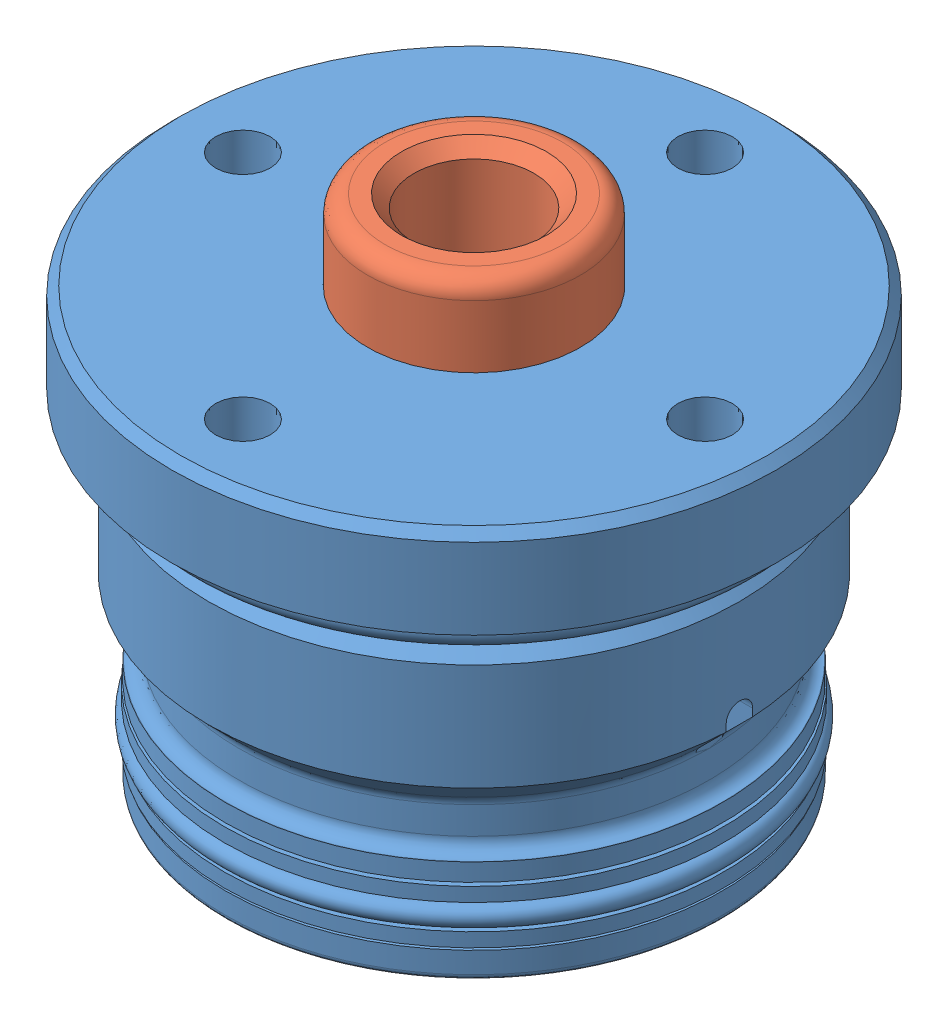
SolidWorks assembly ILC21021301.sldasm, configuration Default (file format 3400). Lengths in mm.
Overall size (53.98 45.24 53.98).
2 component instances, 2 part files, 3 mates.
Components (placement in the parent):
- ILC21021301_BODY-1: ILC21021301_BODY.sldprt [Default] at origin size (53.98 38.1 53.98)
- ILC21021301_PLUNGER-1: ILC21021301_PLUNGER.sldprt [Default] at (0 3.175 0) x (0 1 0) z (0 0 1) size (42.06 34.92 34.92)
Mates (geometry in assembly coordinates):
- MID STROKE: distance = 3.175 mm aligned: plane of ILC21021301_BODY-1 through (-22.1869 0 0) normal (0 -1 0); plane of ILC21021301_PLUNGER-1 through (-6.7437 3.175 0) normal (0 -1 0)
- Concentric1: concentric aligned: cylinder of ILC21021301_BODY-1; cylinder of ILC21021301_PLUNGER-1
- Coincident2: coincident aligned: unknown of ILC21021301_PLUNGER-1
